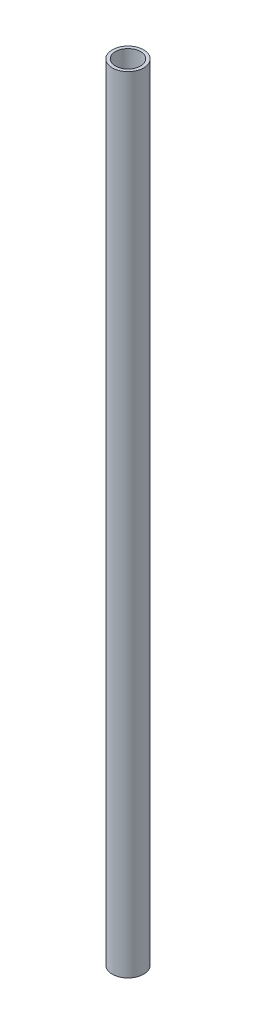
ISO-10303-21;
HEADER;
FILE_DESCRIPTION(('STEP AP214'),'2;1');
FILE_NAME('part.step','',(''),(''),'','','');
FILE_SCHEMA(('AUTOMOTIVE_DESIGN { 1 0 10303 214 1 1 1 1 }'));
ENDSEC;
DATA;
#1=APPLICATION_CONTEXT('core data for automotive mechanical design processes');
#2=APPLICATION_PROTOCOL_DEFINITION('international standard','automotive_design',2000,#1);
#3=PRODUCT_CONTEXT('',#1,'mechanical');
#4=PRODUCT('Part','Part','',(#3));
#5=PRODUCT_RELATED_PRODUCT_CATEGORY('part','',(#4));
#6=PRODUCT_DEFINITION_FORMATION('','',#4);
#7=PRODUCT_DEFINITION_CONTEXT('part definition',#1,'design');
#8=PRODUCT_DEFINITION('design','',#6,#7);
#9=PRODUCT_DEFINITION_SHAPE('','',#8);
#10=(LENGTH_UNIT() NAMED_UNIT(*) SI_UNIT(.MILLI.,.METRE.));
#11=(NAMED_UNIT(*) PLANE_ANGLE_UNIT() SI_UNIT($,.RADIAN.));
#12=(NAMED_UNIT(*) SI_UNIT($,.STERADIAN.) SOLID_ANGLE_UNIT());
#13=UNCERTAINTY_MEASURE_WITH_UNIT(LENGTH_MEASURE(1.E-05),#10,'distance_accuracy_value','');
#14=(GEOMETRIC_REPRESENTATION_CONTEXT(3) GLOBAL_UNCERTAINTY_ASSIGNED_CONTEXT((#13)) GLOBAL_UNIT_ASSIGNED_CONTEXT((#10,
#11,#12)) REPRESENTATION_CONTEXT('',''));
#15=CARTESIAN_POINT('',(0.,0.,0.));
#16=DIRECTION('',(0.,0.,1.));
#17=DIRECTION('',(1.,0.,0.));
#18=AXIS2_PLACEMENT_3D('',#15,#16,#17);
#19=CARTESIAN_POINT('',(0.,250.,0.));
#20=DIRECTION('',(0.,1.,0.));
#21=DIRECTION('',(0.,0.,1.));
#22=AXIS2_PLACEMENT_3D('',#19,#20,#21);
#23=PLANE('',#22);
#24=CARTESIAN_POINT('',(0.,250.,0.));
#25=DIRECTION('',(0.,1.,0.));
#26=DIRECTION('',(0.,0.,1.));
#27=AXIS2_PLACEMENT_3D('',#24,#25,#26);
#28=CIRCLE('',#27,5.);
#29=CARTESIAN_POINT('',(0.,250.,5.));
#30=VERTEX_POINT('',#29);
#31=EDGE_CURVE('E10',#30,#30,#28,.T.);
#32=ORIENTED_EDGE('',*,*,#31,.T.);
#33=EDGE_LOOP('',(#32));
#34=FACE_BOUND('',#33,.T.);
#35=CARTESIAN_POINT('',(0.,250.,0.));
#36=DIRECTION('',(0.,1.,0.));
#37=DIRECTION('',(0.,0.,1.));
#38=AXIS2_PLACEMENT_3D('',#35,#36,#37);
#39=CIRCLE('',#38,4.);
#40=CARTESIAN_POINT('',(0.,250.,4.));
#41=VERTEX_POINT('',#40);
#42=EDGE_CURVE('E58',#41,#41,#39,.T.);
#43=ORIENTED_EDGE('',*,*,#42,.F.);
#44=EDGE_LOOP('',(#43));
#45=FACE_BOUND('',#44,.T.);
#46=ADVANCED_FACE('F45',(#34,#45),#23,.T.);
#47=CARTESIAN_POINT('',(0.,0.,0.));
#48=DIRECTION('',(0.,1.,0.));
#49=DIRECTION('',(0.,0.,1.));
#50=AXIS2_PLACEMENT_3D('',#47,#48,#49);
#51=PLANE('',#50);
#52=CARTESIAN_POINT('',(0.,0.,0.));
#53=DIRECTION('',(0.,1.,0.));
#54=DIRECTION('',(0.,0.,1.));
#55=AXIS2_PLACEMENT_3D('',#52,#53,#54);
#56=CIRCLE('',#55,5.);
#57=CARTESIAN_POINT('',(0.,0.,5.));
#58=VERTEX_POINT('',#57);
#59=EDGE_CURVE('E49',#58,#58,#56,.T.);
#60=ORIENTED_EDGE('',*,*,#59,.F.);
#61=EDGE_LOOP('',(#60));
#62=FACE_BOUND('',#61,.T.);
#63=CARTESIAN_POINT('',(0.,0.,0.));
#64=DIRECTION('',(0.,1.,0.));
#65=DIRECTION('',(0.,0.,1.));
#66=AXIS2_PLACEMENT_3D('',#63,#64,#65);
#67=CIRCLE('',#66,4.);
#68=CARTESIAN_POINT('',(0.,0.,4.));
#69=VERTEX_POINT('',#68);
#70=EDGE_CURVE('E60',#69,#69,#67,.T.);
#71=ORIENTED_EDGE('',*,*,#70,.T.);
#72=EDGE_LOOP('',(#71));
#73=FACE_BOUND('',#72,.T.);
#74=ADVANCED_FACE('F72',(#62,#73),#51,.F.);
#75=CARTESIAN_POINT('',(0.,250.,0.));
#76=DIRECTION('',(0.,-1.,0.));
#77=DIRECTION('',(0.,0.,-1.));
#78=AXIS2_PLACEMENT_3D('',#75,#76,#77);
#79=CYLINDRICAL_SURFACE('',#78,5.);
#80=ORIENTED_EDGE('',*,*,#31,.F.);
#81=EDGE_LOOP('',(#80));
#82=FACE_BOUND('',#81,.T.);
#83=ORIENTED_EDGE('',*,*,#59,.T.);
#84=EDGE_LOOP('',(#83));
#85=FACE_BOUND('',#84,.T.);
#86=ADVANCED_FACE('F47',(#82,#85),#79,.T.);
#87=CARTESIAN_POINT('',(0.,250.,0.));
#88=DIRECTION('',(0.,-1.,0.));
#89=DIRECTION('',(0.,0.,-1.));
#90=AXIS2_PLACEMENT_3D('',#87,#88,#89);
#91=CYLINDRICAL_SURFACE('',#90,4.);
#92=ORIENTED_EDGE('',*,*,#42,.T.);
#93=EDGE_LOOP('',(#92));
#94=FACE_BOUND('',#93,.T.);
#95=ORIENTED_EDGE('',*,*,#70,.F.);
#96=EDGE_LOOP('',(#95));
#97=FACE_BOUND('',#96,.T.);
#98=ADVANCED_FACE('F68',(#94,#97),#91,.F.);
#99=CLOSED_SHELL('',(#46,#74,#86,#98));
#100=MANIFOLD_SOLID_BREP('B2',#99);
#101=ADVANCED_BREP_SHAPE_REPRESENTATION('',(#18,#100),#14);
#102=SHAPE_DEFINITION_REPRESENTATION(#9,#101);
ENDSEC;
END-ISO-10303-21;
